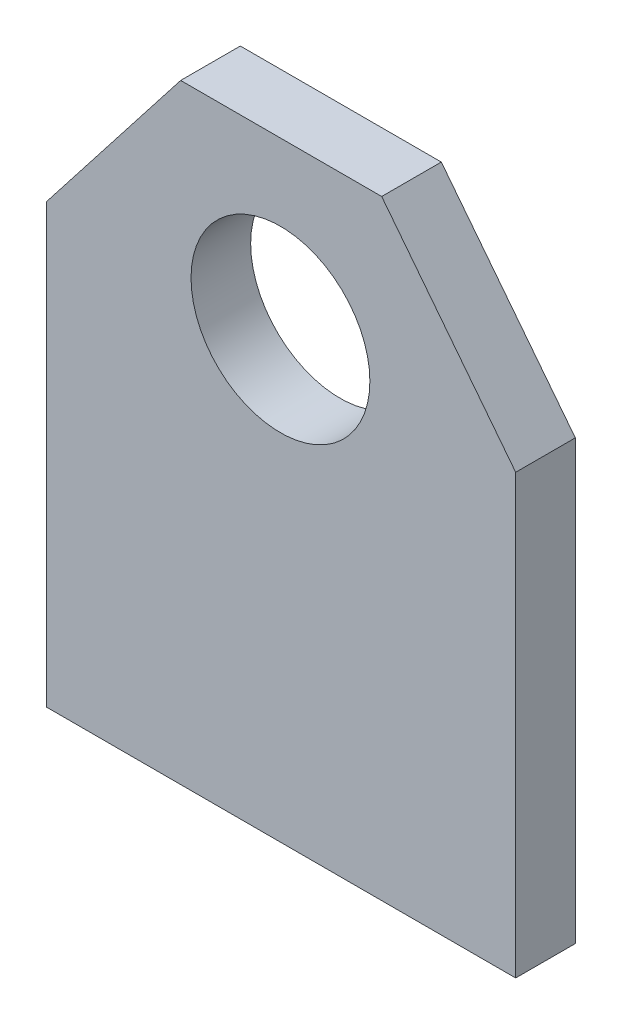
ISO-10303-21;
HEADER;
FILE_DESCRIPTION(('STEP AP214'),'2;1');
FILE_NAME('part.step','',(''),(''),'','','');
FILE_SCHEMA(('AUTOMOTIVE_DESIGN { 1 0 10303 214 1 1 1 1 }'));
ENDSEC;
DATA;
#1=APPLICATION_CONTEXT('core data for automotive mechanical design processes');
#2=APPLICATION_PROTOCOL_DEFINITION('international standard','automotive_design',2000,#1);
#3=PRODUCT_CONTEXT('',#1,'mechanical');
#4=PRODUCT('Part','Part','',(#3));
#5=PRODUCT_RELATED_PRODUCT_CATEGORY('part','',(#4));
#6=PRODUCT_DEFINITION_FORMATION('','',#4);
#7=PRODUCT_DEFINITION_CONTEXT('part definition',#1,'design');
#8=PRODUCT_DEFINITION('design','',#6,#7);
#9=PRODUCT_DEFINITION_SHAPE('','',#8);
#10=(LENGTH_UNIT() NAMED_UNIT(*) SI_UNIT(.MILLI.,.METRE.));
#11=(NAMED_UNIT(*) PLANE_ANGLE_UNIT() SI_UNIT($,.RADIAN.));
#12=(NAMED_UNIT(*) SI_UNIT($,.STERADIAN.) SOLID_ANGLE_UNIT());
#13=UNCERTAINTY_MEASURE_WITH_UNIT(LENGTH_MEASURE(1.E-05),#10,'distance_accuracy_value','');
#14=(GEOMETRIC_REPRESENTATION_CONTEXT(3) GLOBAL_UNCERTAINTY_ASSIGNED_CONTEXT((#13)) GLOBAL_UNIT_ASSIGNED_CONTEXT((#10,
#11,#12)) REPRESENTATION_CONTEXT('',''));
#15=CARTESIAN_POINT('',(0.,0.,0.));
#16=DIRECTION('',(0.,0.,1.));
#17=DIRECTION('',(1.,0.,0.));
#18=AXIS2_PLACEMENT_3D('',#15,#16,#17);
#19=CARTESIAN_POINT('',(0.,0.,8.382));
#20=DIRECTION('',(-1.,0.,0.));
#21=DIRECTION('',(0.,0.,1.));
#22=AXIS2_PLACEMENT_3D('',#19,#20,#21);
#23=PLANE('',#22);
#24=DIRECTION('',(0.,1.,0.));
#25=VECTOR('',#24,1.);
#26=CARTESIAN_POINT('',(0.,0.,0.));
#27=LINE('',#26,#25);
#28=CARTESIAN_POINT('',(0.,0.,0.));
#29=VERTEX_POINT('',#28);
#30=CARTESIAN_POINT('',(0.,61.5673347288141,0.));
#31=VERTEX_POINT('',#30);
#32=EDGE_CURVE('E115',#29,#31,#27,.T.);
#33=ORIENTED_EDGE('',*,*,#32,.T.);
#34=DIRECTION('',(0.,0.,-1.));
#35=VECTOR('',#34,1.);
#36=CARTESIAN_POINT('',(0.,61.5673347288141,8.382));
#37=LINE('',#36,#35);
#38=CARTESIAN_POINT('',(0.,61.5673347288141,8.382));
#39=VERTEX_POINT('',#38);
#40=EDGE_CURVE('E11',#39,#31,#37,.T.);
#41=ORIENTED_EDGE('',*,*,#40,.F.);
#42=DIRECTION('',(0.,1.,0.));
#43=VECTOR('',#42,1.);
#44=CARTESIAN_POINT('',(0.,0.,8.382));
#45=LINE('',#44,#43);
#46=CARTESIAN_POINT('',(0.,0.,8.382));
#47=VERTEX_POINT('',#46);
#48=EDGE_CURVE('E126',#47,#39,#45,.T.);
#49=ORIENTED_EDGE('',*,*,#48,.F.);
#50=DIRECTION('',(0.,0.,-1.));
#51=VECTOR('',#50,1.);
#52=CARTESIAN_POINT('',(0.,0.,8.382));
#53=LINE('',#52,#51);
#54=EDGE_CURVE('E111',#47,#29,#53,.T.);
#55=ORIENTED_EDGE('',*,*,#54,.T.);
#56=EDGE_LOOP('',(#33,#41,#49,#55));
#57=FACE_BOUND('',#56,.T.);
#58=ADVANCED_FACE('F31',(#57),#23,.F.);
#59=CARTESIAN_POINT('',(-18.8370295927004,85.7239336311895,8.382));
#60=DIRECTION('',(-0.788583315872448,-0.614927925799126,0.));
#61=DIRECTION('',(0.614927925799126,-0.788583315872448,0.));
#62=AXIS2_PLACEMENT_3D('',#59,#60,#61);
#63=PLANE('',#62);
#64=DIRECTION('',(-0.614927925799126,0.788583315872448,0.));
#65=VECTOR('',#64,1.);
#66=CARTESIAN_POINT('',(-18.8370295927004,85.7239336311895,0.));
#67=LINE('',#66,#65);
#68=CARTESIAN_POINT('',(-18.8370295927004,85.7239336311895,0.));
#69=VERTEX_POINT('',#68);
#70=EDGE_CURVE('E118',#31,#69,#67,.T.);
#71=ORIENTED_EDGE('',*,*,#70,.T.);
#72=DIRECTION('',(0.,0.,-1.));
#73=VECTOR('',#72,1.);
#74=CARTESIAN_POINT('',(-18.8370295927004,85.7239336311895,8.382));
#75=LINE('',#74,#73);
#76=CARTESIAN_POINT('',(-18.8370295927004,85.7239336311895,8.382));
#77=VERTEX_POINT('',#76);
#78=EDGE_CURVE('E39',#77,#69,#75,.T.);
#79=ORIENTED_EDGE('',*,*,#78,.F.);
#80=DIRECTION('',(-0.614927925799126,0.788583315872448,0.));
#81=VECTOR('',#80,1.);
#82=CARTESIAN_POINT('',(-18.8370295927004,85.7239336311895,8.382));
#83=LINE('',#82,#81);
#84=EDGE_CURVE('E84',#39,#77,#83,.T.);
#85=ORIENTED_EDGE('',*,*,#84,.F.);
#86=ORIENTED_EDGE('',*,*,#40,.T.);
#87=EDGE_LOOP('',(#71,#79,#85,#86));
#88=FACE_BOUND('',#87,.T.);
#89=ADVANCED_FACE('F151',(#88),#63,.F.);
#90=CARTESIAN_POINT('',(-18.8370295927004,85.7239336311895,8.382));
#91=DIRECTION('',(0.,-1.,0.));
#92=DIRECTION('',(0.,0.,-1.));
#93=AXIS2_PLACEMENT_3D('',#90,#91,#92);
#94=PLANE('',#93);
#95=DIRECTION('',(-1.,0.,0.));
#96=VECTOR('',#95,1.);
#97=CARTESIAN_POINT('',(-18.8370295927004,85.7239336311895,0.));
#98=LINE('',#97,#96);
#99=CARTESIAN_POINT('',(-47.0920236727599,85.7239336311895,0.));
#100=VERTEX_POINT('',#99);
#101=EDGE_CURVE('E121',#69,#100,#98,.T.);
#102=ORIENTED_EDGE('',*,*,#101,.T.);
#103=DIRECTION('',(0.,0.,-1.));
#104=VECTOR('',#103,1.);
#105=CARTESIAN_POINT('',(-47.0920236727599,85.7239336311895,8.382));
#106=LINE('',#105,#104);
#107=CARTESIAN_POINT('',(-47.0920236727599,85.7239336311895,8.382));
#108=VERTEX_POINT('',#107);
#109=EDGE_CURVE('E106',#108,#100,#106,.T.);
#110=ORIENTED_EDGE('',*,*,#109,.F.);
#111=DIRECTION('',(-1.,0.,0.));
#112=VECTOR('',#111,1.);
#113=CARTESIAN_POINT('',(-18.8370295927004,85.7239336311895,8.382));
#114=LINE('',#113,#112);
#115=EDGE_CURVE('E97',#77,#108,#114,.T.);
#116=ORIENTED_EDGE('',*,*,#115,.F.);
#117=ORIENTED_EDGE('',*,*,#78,.T.);
#118=EDGE_LOOP('',(#102,#110,#116,#117));
#119=FACE_BOUND('',#118,.T.);
#120=ADVANCED_FACE('F132',(#119),#94,.F.);
#121=CARTESIAN_POINT('',(-47.0920236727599,85.7239336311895,8.382));
#122=DIRECTION('',(0.788583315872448,-0.614927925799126,0.));
#123=DIRECTION('',(0.614927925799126,0.788583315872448,0.));
#124=AXIS2_PLACEMENT_3D('',#121,#122,#123);
#125=PLANE('',#124);
#126=DIRECTION('',(-0.614927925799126,-0.788583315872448,0.));
#127=VECTOR('',#126,1.);
#128=CARTESIAN_POINT('',(-47.0920236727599,85.7239336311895,0.));
#129=LINE('',#128,#127);
#130=CARTESIAN_POINT('',(-65.9290532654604,61.5673347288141,0.));
#131=VERTEX_POINT('',#130);
#132=EDGE_CURVE('E105',#100,#131,#129,.T.);
#133=ORIENTED_EDGE('',*,*,#132,.T.);
#134=DIRECTION('',(0.,0.,-1.));
#135=VECTOR('',#134,1.);
#136=CARTESIAN_POINT('',(-65.9290532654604,61.5673347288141,8.382));
#137=LINE('',#136,#135);
#138=CARTESIAN_POINT('',(-65.9290532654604,61.5673347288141,8.382));
#139=VERTEX_POINT('',#138);
#140=EDGE_CURVE('E102',#139,#131,#137,.T.);
#141=ORIENTED_EDGE('',*,*,#140,.F.);
#142=DIRECTION('',(-0.614927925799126,-0.788583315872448,0.));
#143=VECTOR('',#142,1.);
#144=CARTESIAN_POINT('',(-47.0920236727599,85.7239336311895,8.382));
#145=LINE('',#144,#143);
#146=EDGE_CURVE('E91',#108,#139,#145,.T.);
#147=ORIENTED_EDGE('',*,*,#146,.F.);
#148=ORIENTED_EDGE('',*,*,#109,.T.);
#149=EDGE_LOOP('',(#133,#141,#147,#148));
#150=FACE_BOUND('',#149,.T.);
#151=ADVANCED_FACE('F103',(#150),#125,.F.);
#152=CARTESIAN_POINT('',(-65.9290532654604,0.,8.382));
#153=DIRECTION('',(1.,0.,0.));
#154=DIRECTION('',(0.,0.,-1.));
#155=AXIS2_PLACEMENT_3D('',#152,#153,#154);
#156=PLANE('',#155);
#157=DIRECTION('',(0.,-1.,0.));
#158=VECTOR('',#157,1.);
#159=CARTESIAN_POINT('',(-65.9290532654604,0.,0.));
#160=LINE('',#159,#158);
#161=CARTESIAN_POINT('',(-65.9290532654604,0.,0.));
#162=VERTEX_POINT('',#161);
#163=EDGE_CURVE('E70',#131,#162,#160,.T.);
#164=ORIENTED_EDGE('',*,*,#163,.T.);
#165=DIRECTION('',(0.,0.,-1.));
#166=VECTOR('',#165,1.);
#167=CARTESIAN_POINT('',(-65.9290532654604,0.,8.382));
#168=LINE('',#167,#166);
#169=CARTESIAN_POINT('',(-65.9290532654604,0.,8.382));
#170=VERTEX_POINT('',#169);
#171=EDGE_CURVE('E107',#170,#162,#168,.T.);
#172=ORIENTED_EDGE('',*,*,#171,.F.);
#173=DIRECTION('',(0.,-1.,0.));
#174=VECTOR('',#173,1.);
#175=CARTESIAN_POINT('',(-65.9290532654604,0.,8.382));
#176=LINE('',#175,#174);
#177=EDGE_CURVE('E95',#139,#170,#176,.T.);
#178=ORIENTED_EDGE('',*,*,#177,.F.);
#179=ORIENTED_EDGE('',*,*,#140,.T.);
#180=EDGE_LOOP('',(#164,#172,#178,#179));
#181=FACE_BOUND('',#180,.T.);
#182=ADVANCED_FACE('F109',(#181),#156,.F.);
#183=CARTESIAN_POINT('',(0.,0.,8.382));
#184=DIRECTION('',(0.,1.,0.));
#185=DIRECTION('',(0.,0.,1.));
#186=AXIS2_PLACEMENT_3D('',#183,#184,#185);
#187=PLANE('',#186);
#188=DIRECTION('',(1.,0.,0.));
#189=VECTOR('',#188,1.);
#190=CARTESIAN_POINT('',(0.,0.,0.));
#191=LINE('',#190,#189);
#192=EDGE_CURVE('E76',#162,#29,#191,.T.);
#193=ORIENTED_EDGE('',*,*,#192,.T.);
#194=ORIENTED_EDGE('',*,*,#54,.F.);
#195=DIRECTION('',(1.,0.,0.));
#196=VECTOR('',#195,1.);
#197=CARTESIAN_POINT('',(0.,0.,8.382));
#198=LINE('',#197,#196);
#199=EDGE_CURVE('E47',#170,#47,#198,.T.);
#200=ORIENTED_EDGE('',*,*,#199,.F.);
#201=ORIENTED_EDGE('',*,*,#171,.T.);
#202=EDGE_LOOP('',(#193,#194,#200,#201));
#203=FACE_BOUND('',#202,.T.);
#204=ADVANCED_FACE('F139',(#203),#187,.F.);
#205=CARTESIAN_POINT('',(0.,85.7239336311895,8.382));
#206=DIRECTION('',(0.,0.,1.));
#207=DIRECTION('',(1.,0.,0.));
#208=AXIS2_PLACEMENT_3D('',#205,#206,#207);
#209=PLANE('',#208);
#210=CARTESIAN_POINT('',(-33.0690922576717,62.4157386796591,8.382));
#211=DIRECTION('',(0.,0.,1.));
#212=DIRECTION('',(1.,0.,0.));
#213=AXIS2_PLACEMENT_3D('',#210,#211,#212);
#214=CIRCLE('',#213,12.5705104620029);
#215=CARTESIAN_POINT('',(-20.4985817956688,62.4157386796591,8.382));
#216=VERTEX_POINT('',#215);
#217=EDGE_CURVE('E206',#216,#216,#214,.T.);
#218=ORIENTED_EDGE('',*,*,#217,.F.);
#219=EDGE_LOOP('',(#218));
#220=FACE_BOUND('',#219,.T.);
#221=ORIENTED_EDGE('',*,*,#48,.T.);
#222=ORIENTED_EDGE('',*,*,#84,.T.);
#223=ORIENTED_EDGE('',*,*,#115,.T.);
#224=ORIENTED_EDGE('',*,*,#146,.T.);
#225=ORIENTED_EDGE('',*,*,#177,.T.);
#226=ORIENTED_EDGE('',*,*,#199,.T.);
#227=EDGE_LOOP('',(#221,#222,#223,#224,#225,#226));
#228=FACE_BOUND('',#227,.T.);
#229=ADVANCED_FACE('F93',(#220,#228),#209,.T.);
#230=CARTESIAN_POINT('',(0.,85.7239336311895,0.));
#231=DIRECTION('',(0.,0.,1.));
#232=DIRECTION('',(1.,0.,0.));
#233=AXIS2_PLACEMENT_3D('',#230,#231,#232);
#234=PLANE('',#233);
#235=CARTESIAN_POINT('',(-33.0690922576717,62.4157386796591,0.));
#236=DIRECTION('',(0.,0.,1.));
#237=DIRECTION('',(1.,0.,0.));
#238=AXIS2_PLACEMENT_3D('',#235,#236,#237);
#239=CIRCLE('',#238,12.5705104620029);
#240=CARTESIAN_POINT('',(-20.4985817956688,62.4157386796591,0.));
#241=VERTEX_POINT('',#240);
#242=EDGE_CURVE('E119',#241,#241,#239,.T.);
#243=ORIENTED_EDGE('',*,*,#242,.T.);
#244=EDGE_LOOP('',(#243));
#245=FACE_BOUND('',#244,.T.);
#246=ORIENTED_EDGE('',*,*,#32,.F.);
#247=ORIENTED_EDGE('',*,*,#192,.F.);
#248=ORIENTED_EDGE('',*,*,#163,.F.);
#249=ORIENTED_EDGE('',*,*,#132,.F.);
#250=ORIENTED_EDGE('',*,*,#101,.F.);
#251=ORIENTED_EDGE('',*,*,#70,.F.);
#252=EDGE_LOOP('',(#246,#247,#248,#249,#250,#251));
#253=FACE_BOUND('',#252,.T.);
#254=ADVANCED_FACE('F135',(#245,#253),#234,.F.);
#255=CARTESIAN_POINT('',(-33.0690922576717,62.4157386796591,0.));
#256=DIRECTION('',(0.,0.,1.));
#257=DIRECTION('',(1.,0.,0.));
#258=AXIS2_PLACEMENT_3D('',#255,#256,#257);
#259=CYLINDRICAL_SURFACE('',#258,12.5705104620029);
#260=ORIENTED_EDGE('',*,*,#242,.F.);
#261=EDGE_LOOP('',(#260));
#262=FACE_BOUND('',#261,.T.);
#263=ORIENTED_EDGE('',*,*,#217,.T.);
#264=EDGE_LOOP('',(#263));
#265=FACE_BOUND('',#264,.T.);
#266=ADVANCED_FACE('F188',(#262,#265),#259,.F.);
#267=CLOSED_SHELL('',(#58,#89,#120,#151,#182,#204,#229,#254,#266));
#268=MANIFOLD_SOLID_BREP('B2',#267);
#269=ADVANCED_BREP_SHAPE_REPRESENTATION('',(#18,#268),#14);
#270=SHAPE_DEFINITION_REPRESENTATION(#9,#269);
ENDSEC;
END-ISO-10303-21;
